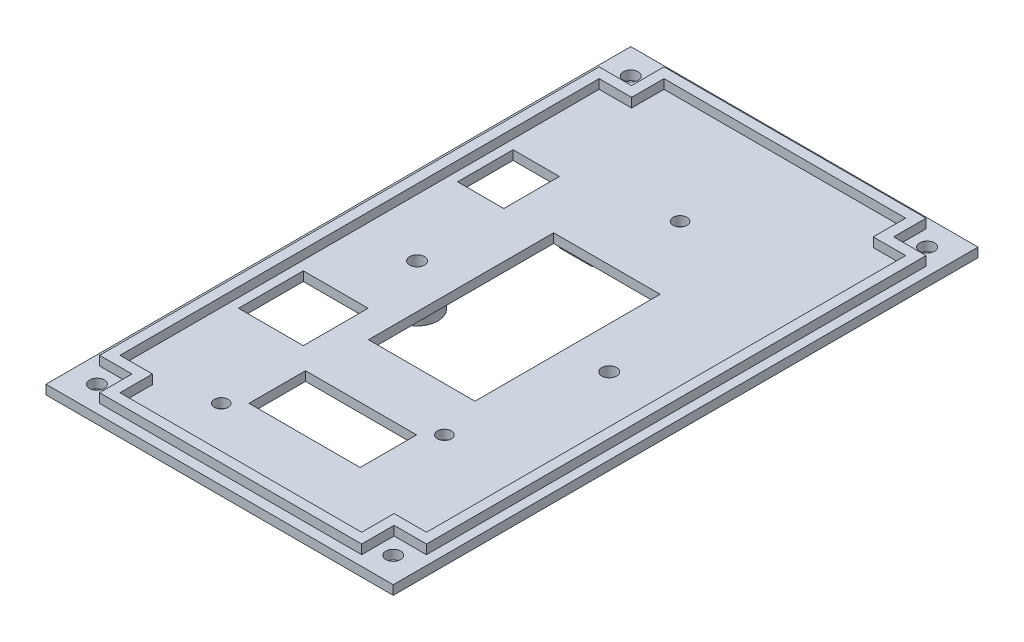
from build123d import *

# Parameters (mm, degrees)
SKETCH_1_W          = 75
SKETCH_1_H          = 126.3
SKETCH_1_R          = 1.6
EXTRUDE_1_DEPTH     = 2
EXTRUDE_3_DEPTH     = 4
SKETCH_3_R          = 1.5
SKETCH_3_W          = 24
SKETCH_3_H          = 12.2
SKETCH_3_R_2        = 1.6
SKETCH_3_W_2        = 23
SKETCH_3_H_2        = 40
CUT_EXTRUDE_1_DEPTH = 2
EXTRUDE_START       = 7
SKETCH_3_3_R        = 4.5
SKETCH_3_3_R_2      = 1.6
EXTRUDE_4_DEPTH     = 7
SKETCH_4_W          = 14
SKETCH_4_H          = 14
SKETCH_4_W_2        = 10
SKETCH_4_H_2        = 12
CUT_EXTRUDE_2_DEPTH = 2
EXTRUDE_6_DEPTH     = 2


with BuildPart() as part:
    # Sketch 1 → Extrude 1 (new body)
    # profile 1 of 4: a face of its own
    with BuildSketch(Plane(origin=(0, 0, 0), x_dir=(1, 0, 0), z_dir=(0, 1, 0))):
        with Locations((-25.370019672, 13.772296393)):
            Rectangle(SKETCH_1_W, SKETCH_1_H)
        with Locations(Location((-57.370019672, 71.422296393, 0), (0, 0, 270))):
            Circle(SKETCH_1_R, mode=Mode.SUBTRACT)
        with Locations(Location((6.629980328, 71.422296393, 0), (0, 0, 270))):
            Circle(SKETCH_1_R, mode=Mode.SUBTRACT)
        with Locations(Location((6.629980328, -43.877703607, 0), (0, 0, 270))):
            Circle(SKETCH_1_R, mode=Mode.SUBTRACT)
        with Locations(Location((-57.370019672, -43.877703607, 0), (0, 0, 270))):
            Circle(SKETCH_1_R, mode=Mode.SUBTRACT)
        Polygon((-60.690971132, 67.922296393), (-60.690971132, -40.377703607), (-53.690971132, -40.377703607), (-53.690971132, -47.377703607), (3.309028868, -47.377703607), (3.309028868, -40.377703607), (10.309028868, -40.377703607), (10.309028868, 67.922296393), (3.309028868, 67.922296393), (3.309028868, 74.922296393), (-53.690971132, 74.922296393), (-53.690971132, 67.922296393), align=None, mode=Mode.SUBTRACT)
    # profile 2 of 4: a face of its own
    with BuildSketch(Plane(origin=(0, 0, 0), x_dir=(1, 0, 0), z_dir=(0, 1, 0))):
        Polygon((-60.690971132, 67.922296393), (-53.690971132, 67.922296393), (-53.690971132, 74.922296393), (3.309028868, 74.922296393), (3.309028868, 67.922296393), (10.309028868, 67.922296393), (10.309028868, -40.377703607), (3.309028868, -40.377703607), (3.309028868, -47.377703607), (-53.690971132, -47.377703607), (-53.690971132, -40.377703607), (-60.690971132, -40.377703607), align=None)
    # profile 3 of 4: a face of its own
    with BuildSketch(Plane(origin=(0, 0, 0), x_dir=(1, 0, 0), z_dir=(0, 1, 0))):
        Polygon((3.109028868, 74.722296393), (3.109028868, 67.722296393), (10.109028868, 67.722296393), (10.109028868, -40.177703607), (3.109028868, -40.177703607), (3.109028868, -47.177703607), (-53.490971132, -47.177703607), (-53.490971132, -40.177703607), (-60.490971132, -40.177703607), (-60.490971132, 67.722296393), (-53.490971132, 67.722296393), (-53.490971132, 74.722296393), align=None)
        Polygon((0.909028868, 72.522296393), (-51.290971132, 72.522296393), (-51.290971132, 65.522296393), (-58.290971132, 65.522296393), (-58.290971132, -37.977703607), (-51.290971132, -37.977703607), (-51.290971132, -44.977703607), (0.909028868, -44.977703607), (0.909028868, -37.977703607), (7.909028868, -37.977703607), (7.909028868, 65.522296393), (0.909028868, 65.522296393), align=None, mode=Mode.SUBTRACT)
    # profile 4 of 4: a face of its own
    with BuildSketch(Plane(origin=(0, 0, 0), x_dir=(1, 0, 0), z_dir=(0, 1, 0))):
        Polygon((0.909028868, 72.522296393), (0.909028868, 65.522296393), (7.909028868, 65.522296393), (7.909028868, -37.977703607), (0.909028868, -37.977703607), (0.909028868, -44.977703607), (-51.290971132, -44.977703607), (-51.290971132, -37.977703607), (-58.290971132, -37.977703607), (-58.290971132, 65.522296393), (-51.290971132, 65.522296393), (-51.290971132, 72.522296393), align=None)
    extrude(amount=EXTRUDE_1_DEPTH)

    # Sketch 1_3 → Extrude 3 (add)
    with BuildSketch(Plane(origin=(0, 0, 0), x_dir=(1, 0, 0), z_dir=(0, 1, 0))):
        Polygon((3.109028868, 74.722296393), (3.109028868, 67.722296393), (10.109028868, 67.722296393), (10.109028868, -40.177703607), (3.109028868, -40.177703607), (3.109028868, -47.177703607), (-53.490971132, -47.177703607), (-53.490971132, -40.177703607), (-60.490971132, -40.177703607), (-60.490971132, 67.722296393), (-53.490971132, 67.722296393), (-53.490971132, 74.722296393), align=None)
        Polygon((0.909028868, 72.522296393), (-51.290971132, 72.522296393), (-51.290971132, 65.522296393), (-58.290971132, 65.522296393), (-58.290971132, -37.977703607), (-51.290971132, -37.977703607), (-51.290971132, -44.977703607), (0.909028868, -44.977703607), (0.909028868, -37.977703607), (7.909028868, -37.977703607), (7.909028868, 65.522296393), (0.909028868, 65.522296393), align=None, mode=Mode.SUBTRACT)
    extrude(amount=EXTRUDE_3_DEPTH)

    # Sketch 3 → Cut-Extrude 1 (cut)
    with BuildSketch(Plane.XZ):
        with Locations(Location((-40.370019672, 34.027703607, 0), (0, 0, 270))):
            Circle(SKETCH_3_R)
        with Locations(Location((-10.370019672, 15.827703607, 0), (0, 0, 270))):
            Circle(SKETCH_3_R)
        with Locations((-25.370019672, 24.927703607)):
            Rectangle(SKETCH_3_W, SKETCH_3_H)
        with Locations(Location((-45.870019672, -13.772296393, 0), (0, 0, 270))):
            Circle(SKETCH_3_R_2)
        with Locations(Location((-4.370019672, -13.772296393, 0), (0, 0, 270))):
            Circle(SKETCH_3_R_2)
        with Locations(Location((-24.870019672, -49.572296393, 0), (0, 0, 270))):
            Circle(SKETCH_3_R)
        with Locations((-24.870019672, -13.772296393)):
            Rectangle(SKETCH_3_W_2, SKETCH_3_H_2)
    extrude(amount=-CUT_EXTRUDE_1_DEPTH, mode=Mode.SUBTRACT)

    # Sketch 3_3 → Extrude 4 (add)
    # profile 1 of 4: a face of its own
    with BuildSketch(Plane.XZ.offset(EXTRUDE_START)):
        with Locations(Location((-45.870019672, -13.772296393, 0), (0, 0, 90))):
            Circle(SKETCH_3_3_R)
        with Locations(Location((-45.870019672, -13.772296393, 0), (0, 0, 270))):
            Circle(SKETCH_3_3_R_2, mode=Mode.SUBTRACT)
    # profile 2 of 4: a face of its own
    with BuildSketch(Plane.XZ.offset(EXTRUDE_START)):
        with Locations(Location((-4.370019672, -13.772296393, 0), (0, 0, 90))):
            Circle(SKETCH_3_3_R)
        with Locations(Location((-4.370019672, -13.772296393, 0), (0, 0, 270))):
            Circle(SKETCH_3_3_R_2, mode=Mode.SUBTRACT)
    # profile 3 of 4: a face of its own
    with BuildSketch(Plane.XZ.offset(EXTRUDE_START)):
        Polygon((-10.870019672, -42.572296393), (-10.870019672, -56.572296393), (-15.870019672, -56.572296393), (-15.870019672, -58.572296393), (-8.870019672, -58.572296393), (-8.870019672, -40.572296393), (-15.870019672, -40.572296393), (-15.870019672, -42.572296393), align=None)
    # profile 4 of 4: a face of its own
    with BuildSketch(Plane.XZ.offset(EXTRUDE_START)):
        Polygon((-34.870019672, -58.572296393), (-34.870019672, -56.572296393), (-39.870019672, -56.572296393), (-39.870019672, -42.572296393), (-34.870019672, -42.572296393), (-34.870019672, -40.572296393), (-41.870019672, -40.572296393), (-41.870019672, -58.572296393), align=None)
    extrude(amount=-EXTRUDE_4_DEPTH)

    # Sketch 4 → Cut-Extrude 2 (cut)
    with BuildSketch(Plane.XZ):
        with Locations((-49.290971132, 7.377703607)):
            Rectangle(SKETCH_4_W, SKETCH_4_H)
        with Locations((-51.290971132, -38.922296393)):
            Rectangle(SKETCH_4_W_2, SKETCH_4_H_2)
    extrude(amount=-CUT_EXTRUDE_2_DEPTH, mode=Mode.SUBTRACT)

    # Sketch 6 → Extrude 6 (add)
    with BuildSketch(Plane.XZ):
        Polygon((-60.670019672, -64.722296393), (-60.670019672, 37.177703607), (-50.670019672, 37.177703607), (-50.670019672, 47.177703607), (-0.070019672, 47.177703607), (-0.070019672, 37.177703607), (9.929980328, 37.177703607), (9.929980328, -64.722296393), (-0.070019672, -64.722296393), (-0.070019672, -74.722296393), (-50.670019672, -74.722296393), (-50.670019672, -64.722296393), align=None)
        Polygon((-58.670019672, -62.722296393), (-48.670019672, -62.722296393), (-48.670019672, -72.722296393), (-2.070019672, -72.722296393), (-2.070019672, -62.722296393), (7.929980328, -62.722296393), (7.929980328, 35.177703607), (-2.070019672, 35.177703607), (-2.070019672, 45.177703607), (-48.670019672, 45.177703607), (-48.670019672, 35.177703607), (-58.670019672, 35.177703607), align=None, mode=Mode.SUBTRACT)
    extrude(amount=EXTRUDE_6_DEPTH)


solid = part.part
